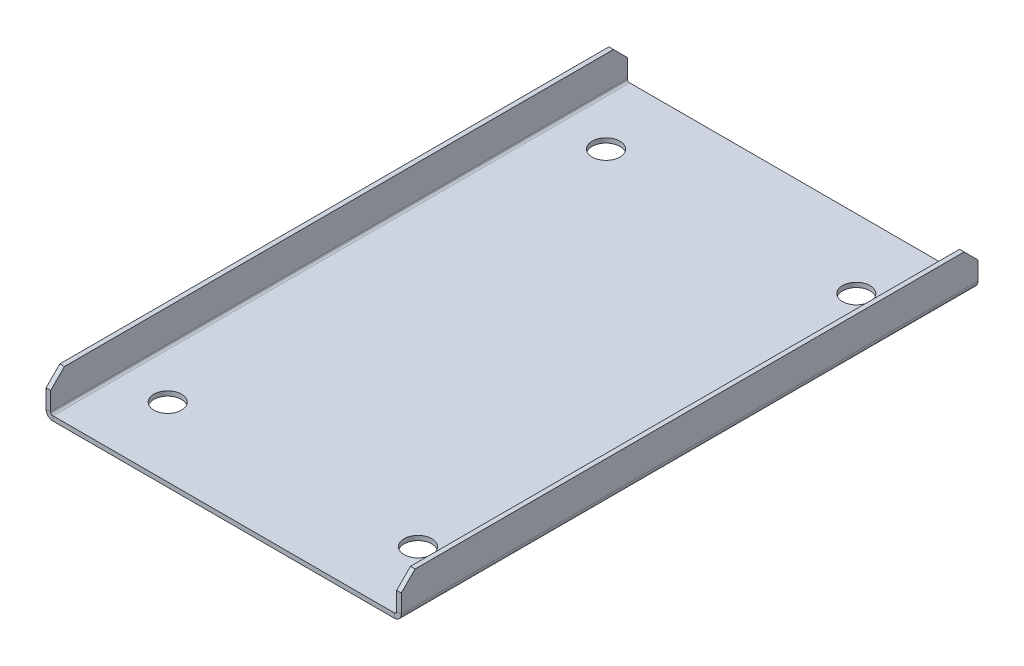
ISO-10303-21;
HEADER;
FILE_DESCRIPTION(('STEP AP214'),'2;1');
FILE_NAME('part.step','',(''),(''),'','','');
FILE_SCHEMA(('AUTOMOTIVE_DESIGN { 1 0 10303 214 1 1 1 1 }'));
ENDSEC;
DATA;
#1=APPLICATION_CONTEXT('core data for automotive mechanical design processes');
#2=APPLICATION_PROTOCOL_DEFINITION('international standard','automotive_design',2000,#1);
#3=PRODUCT_CONTEXT('',#1,'mechanical');
#4=PRODUCT('Part','Part','',(#3));
#5=PRODUCT_RELATED_PRODUCT_CATEGORY('part','',(#4));
#6=PRODUCT_DEFINITION_FORMATION('','',#4);
#7=PRODUCT_DEFINITION_CONTEXT('part definition',#1,'design');
#8=PRODUCT_DEFINITION('design','',#6,#7);
#9=PRODUCT_DEFINITION_SHAPE('','',#8);
#10=(LENGTH_UNIT() NAMED_UNIT(*) SI_UNIT(.MILLI.,.METRE.));
#11=(NAMED_UNIT(*) PLANE_ANGLE_UNIT() SI_UNIT($,.RADIAN.));
#12=(NAMED_UNIT(*) SI_UNIT($,.STERADIAN.) SOLID_ANGLE_UNIT());
#13=UNCERTAINTY_MEASURE_WITH_UNIT(LENGTH_MEASURE(1.E-05),#10,'distance_accuracy_value','');
#14=(GEOMETRIC_REPRESENTATION_CONTEXT(3) GLOBAL_UNCERTAINTY_ASSIGNED_CONTEXT((#13)) GLOBAL_UNIT_ASSIGNED_CONTEXT((#10,
#11,#12)) REPRESENTATION_CONTEXT('',''));
#15=CARTESIAN_POINT('',(0.,0.,0.));
#16=DIRECTION('',(0.,0.,1.));
#17=DIRECTION('',(1.,0.,0.));
#18=AXIS2_PLACEMENT_3D('',#15,#16,#17);
#19=CARTESIAN_POINT('',(-350.783386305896,15.,-250.));
#20=DIRECTION('',(0.,1.,0.));
#21=DIRECTION('',(-1.,0.,0.));
#22=AXIS2_PLACEMENT_3D('',#19,#20,#21);
#23=PLANE('',#22);
#24=DIRECTION('',(1.,0.,0.));
#25=VECTOR('',#24,1.);
#26=CARTESIAN_POINT('',(-350.783386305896,15.,-6.00000000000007));
#27=LINE('',#26,#25);
#28=CARTESIAN_POINT('',(150.,15.,-6.00000000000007));
#29=VERTEX_POINT('',#28);
#30=CARTESIAN_POINT('',(152.,15.,-6.00000000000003));
#31=VERTEX_POINT('',#30);
#32=EDGE_CURVE('E283',#29,#31,#27,.T.);
#33=ORIENTED_EDGE('',*,*,#32,.T.);
#34=DIRECTION('',(0.,0.,1.));
#35=VECTOR('',#34,1.);
#36=CARTESIAN_POINT('',(152.,15.,-250.));
#37=LINE('',#36,#35);
#38=CARTESIAN_POINT('',(152.,15.,-244.));
#39=VERTEX_POINT('',#38);
#40=EDGE_CURVE('E267',#39,#31,#37,.T.);
#41=ORIENTED_EDGE('',*,*,#40,.F.);
#42=DIRECTION('',(1.,0.,0.));
#43=VECTOR('',#42,1.);
#44=CARTESIAN_POINT('',(-350.783386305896,15.,-244.));
#45=LINE('',#44,#43);
#46=CARTESIAN_POINT('',(150.,15.,-244.));
#47=VERTEX_POINT('',#46);
#48=EDGE_CURVE('E278',#47,#39,#45,.T.);
#49=ORIENTED_EDGE('',*,*,#48,.F.);
#50=DIRECTION('',(0.,0.,1.));
#51=VECTOR('',#50,1.);
#52=CARTESIAN_POINT('',(150.,15.,-250.));
#53=LINE('',#52,#51);
#54=EDGE_CURVE('E281',#47,#29,#53,.T.);
#55=ORIENTED_EDGE('',*,*,#54,.T.);
#56=EDGE_LOOP('',(#33,#41,#49,#55));
#57=FACE_BOUND('',#56,.T.);
#58=ADVANCED_FACE('F29',(#57),#23,.T.);
#59=CARTESIAN_POINT('',(-350.783386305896,9.00000000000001,-250.));
#60=DIRECTION('',(0.,-0.707106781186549,0.707106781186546));
#61=DIRECTION('',(0.,0.707106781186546,0.707106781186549));
#62=AXIS2_PLACEMENT_3D('',#59,#60,#61);
#63=PLANE('',#62);
#64=DIRECTION('',(0.,0.707106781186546,0.707106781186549));
#65=VECTOR('',#64,1.);
#66=CARTESIAN_POINT('',(152.,4.50000000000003,-254.5));
#67=LINE('',#66,#65);
#68=CARTESIAN_POINT('',(152.,9.00000000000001,-250.));
#69=VERTEX_POINT('',#68);
#70=EDGE_CURVE('E269',#69,#39,#67,.T.);
#71=ORIENTED_EDGE('',*,*,#70,.F.);
#72=DIRECTION('',(1.,0.,0.));
#73=VECTOR('',#72,1.);
#74=CARTESIAN_POINT('',(-350.783386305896,9.00000000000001,-250.));
#75=LINE('',#74,#73);
#76=CARTESIAN_POINT('',(150.,9.00000000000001,-250.));
#77=VERTEX_POINT('',#76);
#78=EDGE_CURVE('E263',#77,#69,#75,.T.);
#79=ORIENTED_EDGE('',*,*,#78,.F.);
#80=DIRECTION('',(0.,-0.707106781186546,-0.707106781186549));
#81=VECTOR('',#80,1.);
#82=CARTESIAN_POINT('',(150.,9.00000000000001,-250.));
#83=LINE('',#82,#81);
#84=EDGE_CURVE('E11',#47,#77,#83,.T.);
#85=ORIENTED_EDGE('',*,*,#84,.F.);
#86=ORIENTED_EDGE('',*,*,#48,.T.);
#87=EDGE_LOOP('',(#71,#79,#85,#86));
#88=FACE_BOUND('',#87,.T.);
#89=ADVANCED_FACE('F359',(#88),#63,.F.);
#90=CARTESIAN_POINT('',(-350.783386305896,15.,-6.00000000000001));
#91=DIRECTION('',(0.,-0.707106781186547,-0.707106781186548));
#92=DIRECTION('',(0.,-0.707106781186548,0.707106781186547));
#93=AXIS2_PLACEMENT_3D('',#90,#91,#92);
#94=PLANE('',#93);
#95=DIRECTION('',(0.,0.707106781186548,-0.707106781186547));
#96=VECTOR('',#95,1.);
#97=CARTESIAN_POINT('',(152.,129.5,-120.5));
#98=LINE('',#97,#96);
#99=CARTESIAN_POINT('',(152.,8.99999999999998,0.));
#100=VERTEX_POINT('',#99);
#101=EDGE_CURVE('E265',#31,#100,#98,.F.);
#102=ORIENTED_EDGE('',*,*,#101,.F.);
#103=ORIENTED_EDGE('',*,*,#32,.F.);
#104=DIRECTION('',(0.,-0.707106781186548,0.707106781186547));
#105=VECTOR('',#104,1.);
#106=CARTESIAN_POINT('',(150.,15.,-6.00000000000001));
#107=LINE('',#106,#105);
#108=CARTESIAN_POINT('',(150.,8.99999999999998,0.));
#109=VERTEX_POINT('',#108);
#110=EDGE_CURVE('E39',#109,#29,#107,.F.);
#111=ORIENTED_EDGE('',*,*,#110,.F.);
#112=DIRECTION('',(1.,0.,0.));
#113=VECTOR('',#112,1.);
#114=CARTESIAN_POINT('',(-350.783386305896,8.99999999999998,0.));
#115=LINE('',#114,#113);
#116=EDGE_CURVE('E275',#109,#100,#115,.T.);
#117=ORIENTED_EDGE('',*,*,#116,.T.);
#118=EDGE_LOOP('',(#102,#103,#111,#117));
#119=FACE_BOUND('',#118,.T.);
#120=ADVANCED_FACE('F365',(#119),#94,.F.);
#121=CARTESIAN_POINT('',(-350.783386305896,0.,0.));
#122=DIRECTION('',(0.,0.,-1.));
#123=DIRECTION('',(0.,-1.,0.));
#124=AXIS2_PLACEMENT_3D('',#121,#122,#123);
#125=PLANE('',#124);
#126=DIRECTION('',(0.,1.,0.));
#127=VECTOR('',#126,1.);
#128=CARTESIAN_POINT('',(152.,0.,0.));
#129=LINE('',#128,#127);
#130=CARTESIAN_POINT('',(152.,0.999999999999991,1.11022302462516E-13));
#131=VERTEX_POINT('',#130);
#132=EDGE_CURVE('E272',#131,#100,#129,.T.);
#133=ORIENTED_EDGE('',*,*,#132,.T.);
#134=ORIENTED_EDGE('',*,*,#116,.F.);
#135=DIRECTION('',(0.,1.,0.));
#136=VECTOR('',#135,1.);
#137=CARTESIAN_POINT('',(150.,0.,0.));
#138=LINE('',#137,#136);
#139=CARTESIAN_POINT('',(150.,1.,0.));
#140=VERTEX_POINT('',#139);
#141=EDGE_CURVE('E85',#140,#109,#138,.T.);
#142=ORIENTED_EDGE('',*,*,#141,.F.);
#143=DIRECTION('',(1.,0.,0.));
#144=VECTOR('',#143,1.);
#145=CARTESIAN_POINT('',(-350.783386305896,1.,0.));
#146=LINE('',#145,#144);
#147=EDGE_CURVE('E175',#140,#131,#146,.T.);
#148=ORIENTED_EDGE('',*,*,#147,.T.);
#149=EDGE_LOOP('',(#133,#134,#142,#148));
#150=FACE_BOUND('',#149,.T.);
#151=ADVANCED_FACE('F373',(#150),#125,.F.);
#152=CARTESIAN_POINT('',(152.,0.,-250.));
#153=DIRECTION('',(1.,0.,0.));
#154=DIRECTION('',(0.,0.,-1.));
#155=AXIS2_PLACEMENT_3D('',#152,#153,#154);
#156=PLANE('',#155);
#157=DIRECTION('',(0.,0.,1.));
#158=VECTOR('',#157,1.);
#159=CARTESIAN_POINT('',(152.,1.,0.));
#160=LINE('',#159,#158);
#161=CARTESIAN_POINT('',(152.,1.,-250.));
#162=VERTEX_POINT('',#161);
#163=EDGE_CURVE('E285',#162,#131,#160,.T.);
#164=ORIENTED_EDGE('',*,*,#163,.F.);
#165=DIRECTION('',(0.,-1.,0.));
#166=VECTOR('',#165,1.);
#167=CARTESIAN_POINT('',(152.,0.,-250.));
#168=LINE('',#167,#166);
#169=EDGE_CURVE('E261',#69,#162,#168,.T.);
#170=ORIENTED_EDGE('',*,*,#169,.F.);
#171=ORIENTED_EDGE('',*,*,#70,.T.);
#172=ORIENTED_EDGE('',*,*,#40,.T.);
#173=ORIENTED_EDGE('',*,*,#101,.T.);
#174=ORIENTED_EDGE('',*,*,#132,.F.);
#175=EDGE_LOOP('',(#164,#170,#171,#172,#173,#174));
#176=FACE_BOUND('',#175,.T.);
#177=ADVANCED_FACE('F377',(#176),#156,.T.);
#178=CARTESIAN_POINT('',(-350.783386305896,0.,-250.));
#179=DIRECTION('',(0.,0.,-1.));
#180=DIRECTION('',(0.,-1.,0.));
#181=AXIS2_PLACEMENT_3D('',#178,#179,#180);
#182=PLANE('',#181);
#183=ORIENTED_EDGE('',*,*,#78,.T.);
#184=ORIENTED_EDGE('',*,*,#169,.T.);
#185=DIRECTION('',(1.,0.,0.));
#186=VECTOR('',#185,1.);
#187=CARTESIAN_POINT('',(-350.783386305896,1.,-250.));
#188=LINE('',#187,#186);
#189=CARTESIAN_POINT('',(150.,1.,-250.));
#190=VERTEX_POINT('',#189);
#191=EDGE_CURVE('E33',#190,#162,#188,.T.);
#192=ORIENTED_EDGE('',*,*,#191,.F.);
#193=DIRECTION('',(0.,-1.,0.));
#194=VECTOR('',#193,1.);
#195=CARTESIAN_POINT('',(150.,0.,-250.));
#196=LINE('',#195,#194);
#197=EDGE_CURVE('E48',#77,#190,#196,.T.);
#198=ORIENTED_EDGE('',*,*,#197,.F.);
#199=EDGE_LOOP('',(#183,#184,#192,#198));
#200=FACE_BOUND('',#199,.T.);
#201=ADVANCED_FACE('F379',(#200),#182,.T.);
#202=CARTESIAN_POINT('',(150.,0.,-250.));
#203=DIRECTION('',(1.,0.,0.));
#204=DIRECTION('',(0.,0.,-1.));
#205=AXIS2_PLACEMENT_3D('',#202,#203,#204);
#206=PLANE('',#205);
#207=ORIENTED_EDGE('',*,*,#197,.T.);
#208=DIRECTION('',(0.,0.,1.));
#209=VECTOR('',#208,1.);
#210=CARTESIAN_POINT('',(150.,1.,0.));
#211=LINE('',#210,#209);
#212=EDGE_CURVE('E258',#190,#140,#211,.T.);
#213=ORIENTED_EDGE('',*,*,#212,.T.);
#214=ORIENTED_EDGE('',*,*,#141,.T.);
#215=ORIENTED_EDGE('',*,*,#110,.T.);
#216=ORIENTED_EDGE('',*,*,#54,.F.);
#217=ORIENTED_EDGE('',*,*,#84,.T.);
#218=EDGE_LOOP('',(#207,#213,#214,#215,#216,#217));
#219=FACE_BOUND('',#218,.T.);
#220=ADVANCED_FACE('F31',(#219),#206,.F.);
#221=CARTESIAN_POINT('',(500.783386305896,15.,-250.));
#222=DIRECTION('',(0.,-1.,0.));
#223=DIRECTION('',(1.,0.,0.));
#224=AXIS2_PLACEMENT_3D('',#221,#222,#223);
#225=PLANE('',#224);
#226=DIRECTION('',(0.,0.,1.));
#227=VECTOR('',#226,1.);
#228=CARTESIAN_POINT('',(-2.,15.,-250.));
#229=LINE('',#228,#227);
#230=CARTESIAN_POINT('',(-2.,15.,-244.));
#231=VERTEX_POINT('',#230);
#232=CARTESIAN_POINT('',(-2.,15.,-6.00000000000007));
#233=VERTEX_POINT('',#232);
#234=EDGE_CURVE('E248',#231,#233,#229,.T.);
#235=ORIENTED_EDGE('',*,*,#234,.T.);
#236=DIRECTION('',(-1.,0.,0.));
#237=VECTOR('',#236,1.);
#238=CARTESIAN_POINT('',(500.783386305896,15.,-6.00000000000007));
#239=LINE('',#238,#237);
#240=CARTESIAN_POINT('',(0.,15.,-6.00000000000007));
#241=VERTEX_POINT('',#240);
#242=EDGE_CURVE('E242',#241,#233,#239,.T.);
#243=ORIENTED_EDGE('',*,*,#242,.F.);
#244=DIRECTION('',(0.,0.,1.));
#245=VECTOR('',#244,1.);
#246=CARTESIAN_POINT('',(0.,15.,-250.));
#247=LINE('',#246,#245);
#248=CARTESIAN_POINT('',(0.,15.,-244.));
#249=VERTEX_POINT('',#248);
#250=EDGE_CURVE('E216',#249,#241,#247,.T.);
#251=ORIENTED_EDGE('',*,*,#250,.F.);
#252=DIRECTION('',(-1.,0.,0.));
#253=VECTOR('',#252,1.);
#254=CARTESIAN_POINT('',(500.783386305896,15.,-244.));
#255=LINE('',#254,#253);
#256=EDGE_CURVE('E245',#249,#231,#255,.T.);
#257=ORIENTED_EDGE('',*,*,#256,.T.);
#258=EDGE_LOOP('',(#235,#243,#251,#257));
#259=FACE_BOUND('',#258,.T.);
#260=ADVANCED_FACE('F385',(#259),#225,.F.);
#261=CARTESIAN_POINT('',(500.783386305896,15.,-6.00000000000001));
#262=DIRECTION('',(0.,-0.707106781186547,-0.707106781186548));
#263=DIRECTION('',(0.,0.707106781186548,-0.707106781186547));
#264=AXIS2_PLACEMENT_3D('',#261,#262,#263);
#265=PLANE('',#264);
#266=DIRECTION('',(0.,-0.707106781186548,0.707106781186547));
#267=VECTOR('',#266,1.);
#268=CARTESIAN_POINT('',(-2.,137.,-128.));
#269=LINE('',#268,#267);
#270=CARTESIAN_POINT('',(-2.,8.99999999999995,0.));
#271=VERTEX_POINT('',#270);
#272=EDGE_CURVE('E231',#271,#233,#269,.F.);
#273=ORIENTED_EDGE('',*,*,#272,.F.);
#274=DIRECTION('',(-1.,0.,0.));
#275=VECTOR('',#274,1.);
#276=CARTESIAN_POINT('',(500.783386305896,8.99999999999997,0.));
#277=LINE('',#276,#275);
#278=CARTESIAN_POINT('',(0.,8.99999999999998,0.));
#279=VERTEX_POINT('',#278);
#280=EDGE_CURVE('E222',#279,#271,#277,.T.);
#281=ORIENTED_EDGE('',*,*,#280,.F.);
#282=DIRECTION('',(0.,0.707106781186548,-0.707106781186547));
#283=VECTOR('',#282,1.);
#284=CARTESIAN_POINT('',(0.,15.,-6.00000000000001));
#285=LINE('',#284,#283);
#286=EDGE_CURVE('E94',#241,#279,#285,.F.);
#287=ORIENTED_EDGE('',*,*,#286,.F.);
#288=ORIENTED_EDGE('',*,*,#242,.T.);
#289=EDGE_LOOP('',(#273,#281,#287,#288));
#290=FACE_BOUND('',#289,.T.);
#291=ADVANCED_FACE('F397',(#290),#265,.F.);
#292=CARTESIAN_POINT('',(500.783386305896,8.99999999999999,-250.));
#293=DIRECTION('',(0.,-0.707106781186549,0.707106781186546));
#294=DIRECTION('',(0.,-0.707106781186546,-0.707106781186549));
#295=AXIS2_PLACEMENT_3D('',#292,#293,#294);
#296=PLANE('',#295);
#297=DIRECTION('',(0.,-0.707106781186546,-0.707106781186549));
#298=VECTOR('',#297,1.);
#299=CARTESIAN_POINT('',(-2.,12.,-247.));
#300=LINE('',#299,#298);
#301=CARTESIAN_POINT('',(-2.,8.99999999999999,-250.));
#302=VERTEX_POINT('',#301);
#303=EDGE_CURVE('E228',#231,#302,#300,.T.);
#304=ORIENTED_EDGE('',*,*,#303,.F.);
#305=ORIENTED_EDGE('',*,*,#256,.F.);
#306=DIRECTION('',(0.,0.707106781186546,0.707106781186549));
#307=VECTOR('',#306,1.);
#308=CARTESIAN_POINT('',(0.,8.99999999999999,-250.));
#309=LINE('',#308,#307);
#310=CARTESIAN_POINT('',(0.,8.99999999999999,-250.));
#311=VERTEX_POINT('',#310);
#312=EDGE_CURVE('E218',#311,#249,#309,.T.);
#313=ORIENTED_EDGE('',*,*,#312,.F.);
#314=DIRECTION('',(-1.,0.,0.));
#315=VECTOR('',#314,1.);
#316=CARTESIAN_POINT('',(500.783386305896,8.99999999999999,-250.));
#317=LINE('',#316,#315);
#318=EDGE_CURVE('E239',#311,#302,#317,.T.);
#319=ORIENTED_EDGE('',*,*,#318,.T.);
#320=EDGE_LOOP('',(#304,#305,#313,#319));
#321=FACE_BOUND('',#320,.T.);
#322=ADVANCED_FACE('F403',(#321),#296,.F.);
#323=CARTESIAN_POINT('',(500.783386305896,15.,-250.));
#324=DIRECTION('',(0.,0.,-1.));
#325=DIRECTION('',(0.,1.,0.));
#326=AXIS2_PLACEMENT_3D('',#323,#324,#325);
#327=PLANE('',#326);
#328=DIRECTION('',(-1.,0.,0.));
#329=VECTOR('',#328,1.);
#330=CARTESIAN_POINT('',(500.783386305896,0.999999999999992,-250.));
#331=LINE('',#330,#329);
#332=CARTESIAN_POINT('',(0.,0.999999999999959,-250.));
#333=VERTEX_POINT('',#332);
#334=CARTESIAN_POINT('',(-2.,0.999999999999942,-250.));
#335=VERTEX_POINT('',#334);
#336=EDGE_CURVE('E236',#333,#335,#331,.T.);
#337=ORIENTED_EDGE('',*,*,#336,.T.);
#338=DIRECTION('',(0.,-1.,0.));
#339=VECTOR('',#338,1.);
#340=CARTESIAN_POINT('',(-2.,15.,-250.));
#341=LINE('',#340,#339);
#342=EDGE_CURVE('E226',#302,#335,#341,.T.);
#343=ORIENTED_EDGE('',*,*,#342,.F.);
#344=ORIENTED_EDGE('',*,*,#318,.F.);
#345=DIRECTION('',(0.,-1.,0.));
#346=VECTOR('',#345,1.);
#347=CARTESIAN_POINT('',(0.,15.,-250.));
#348=LINE('',#347,#346);
#349=EDGE_CURVE('E234',#311,#333,#348,.T.);
#350=ORIENTED_EDGE('',*,*,#349,.T.);
#351=EDGE_LOOP('',(#337,#343,#344,#350));
#352=FACE_BOUND('',#351,.T.);
#353=ADVANCED_FACE('F409',(#352),#327,.T.);
#354=CARTESIAN_POINT('',(-2.,15.,-250.));
#355=DIRECTION('',(-1.,0.,0.));
#356=DIRECTION('',(0.,-1.,0.));
#357=AXIS2_PLACEMENT_3D('',#354,#355,#356);
#358=PLANE('',#357);
#359=DIRECTION('',(0.,0.,-1.));
#360=VECTOR('',#359,1.);
#361=CARTESIAN_POINT('',(-2.,1.,-250.));
#362=LINE('',#361,#360);
#363=CARTESIAN_POINT('',(-2.,0.999999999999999,0.));
#364=VERTEX_POINT('',#363);
#365=EDGE_CURVE('E250',#364,#335,#362,.T.);
#366=ORIENTED_EDGE('',*,*,#365,.F.);
#367=DIRECTION('',(0.,-1.,0.));
#368=VECTOR('',#367,1.);
#369=CARTESIAN_POINT('',(-2.,15.,0.));
#370=LINE('',#369,#368);
#371=EDGE_CURVE('E224',#271,#364,#370,.T.);
#372=ORIENTED_EDGE('',*,*,#371,.F.);
#373=ORIENTED_EDGE('',*,*,#272,.T.);
#374=ORIENTED_EDGE('',*,*,#234,.F.);
#375=ORIENTED_EDGE('',*,*,#303,.T.);
#376=ORIENTED_EDGE('',*,*,#342,.T.);
#377=EDGE_LOOP('',(#366,#372,#373,#374,#375,#376));
#378=FACE_BOUND('',#377,.T.);
#379=ADVANCED_FACE('F413',(#378),#358,.T.);
#380=CARTESIAN_POINT('',(500.783386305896,15.,0.));
#381=DIRECTION('',(0.,0.,-1.));
#382=DIRECTION('',(0.,1.,0.));
#383=AXIS2_PLACEMENT_3D('',#380,#381,#382);
#384=PLANE('',#383);
#385=ORIENTED_EDGE('',*,*,#371,.T.);
#386=DIRECTION('',(-1.,0.,0.));
#387=VECTOR('',#386,1.);
#388=CARTESIAN_POINT('',(500.783386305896,0.999999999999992,0.));
#389=LINE('',#388,#387);
#390=CARTESIAN_POINT('',(0.,0.999999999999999,0.));
#391=VERTEX_POINT('',#390);
#392=EDGE_CURVE('E214',#391,#364,#389,.T.);
#393=ORIENTED_EDGE('',*,*,#392,.F.);
#394=DIRECTION('',(0.,-1.,0.));
#395=VECTOR('',#394,1.);
#396=CARTESIAN_POINT('',(0.,15.,0.));
#397=LINE('',#396,#395);
#398=EDGE_CURVE('E123',#279,#391,#397,.T.);
#399=ORIENTED_EDGE('',*,*,#398,.F.);
#400=ORIENTED_EDGE('',*,*,#280,.T.);
#401=EDGE_LOOP('',(#385,#393,#399,#400));
#402=FACE_BOUND('',#401,.T.);
#403=ADVANCED_FACE('F416',(#402),#384,.F.);
#404=CARTESIAN_POINT('',(0.,15.,-250.));
#405=DIRECTION('',(-1.,0.,0.));
#406=DIRECTION('',(0.,-1.,0.));
#407=AXIS2_PLACEMENT_3D('',#404,#405,#406);
#408=PLANE('',#407);
#409=ORIENTED_EDGE('',*,*,#398,.T.);
#410=DIRECTION('',(0.,0.,-1.));
#411=VECTOR('',#410,1.);
#412=CARTESIAN_POINT('',(0.,1.,-250.));
#413=LINE('',#412,#411);
#414=EDGE_CURVE('E126',#391,#333,#413,.T.);
#415=ORIENTED_EDGE('',*,*,#414,.T.);
#416=ORIENTED_EDGE('',*,*,#349,.F.);
#417=ORIENTED_EDGE('',*,*,#312,.T.);
#418=ORIENTED_EDGE('',*,*,#250,.T.);
#419=ORIENTED_EDGE('',*,*,#286,.T.);
#420=EDGE_LOOP('',(#409,#415,#416,#417,#418,#419));
#421=FACE_BOUND('',#420,.T.);
#422=ADVANCED_FACE('F356',(#421),#408,.F.);
#423=CARTESIAN_POINT('',(0.,581.047330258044,0.));
#424=DIRECTION('',(0.,0.,-1.));
#425=DIRECTION('',(-1.,0.,0.));
#426=AXIS2_PLACEMENT_3D('',#423,#424,#425);
#427=PLANE('',#426);
#428=DIRECTION('',(1.,0.,0.));
#429=VECTOR('',#428,1.);
#430=CARTESIAN_POINT('',(0.,-2.,0.));
#431=LINE('',#430,#429);
#432=CARTESIAN_POINT('',(1.,-2.,0.));
#433=VERTEX_POINT('',#432);
#434=CARTESIAN_POINT('',(149.,-2.00000000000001,1.11022302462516E-13));
#435=VERTEX_POINT('',#434);
#436=EDGE_CURVE('E204',#433,#435,#431,.T.);
#437=ORIENTED_EDGE('',*,*,#436,.T.);
#438=DIRECTION('',(0.,-1.,0.));
#439=VECTOR('',#438,1.);
#440=CARTESIAN_POINT('',(149.,581.047330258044,0.));
#441=LINE('',#440,#439);
#442=CARTESIAN_POINT('',(149.,0.,1.11022302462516E-13));
#443=VERTEX_POINT('',#442);
#444=EDGE_CURVE('E174',#443,#435,#441,.T.);
#445=ORIENTED_EDGE('',*,*,#444,.F.);
#446=DIRECTION('',(1.,0.,0.));
#447=VECTOR('',#446,1.);
#448=CARTESIAN_POINT('',(0.,0.,0.));
#449=LINE('',#448,#447);
#450=CARTESIAN_POINT('',(1.,0.,0.));
#451=VERTEX_POINT('',#450);
#452=EDGE_CURVE('E194',#451,#443,#449,.T.);
#453=ORIENTED_EDGE('',*,*,#452,.F.);
#454=DIRECTION('',(0.,-1.,0.));
#455=VECTOR('',#454,1.);
#456=CARTESIAN_POINT('',(1.,581.047330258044,0.));
#457=LINE('',#456,#455);
#458=EDGE_CURVE('E189',#451,#433,#457,.T.);
#459=ORIENTED_EDGE('',*,*,#458,.T.);
#460=EDGE_LOOP('',(#437,#445,#453,#459));
#461=FACE_BOUND('',#460,.T.);
#462=ADVANCED_FACE('F202',(#461),#427,.F.);
#463=CARTESIAN_POINT('',(0.,581.047330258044,-250.));
#464=DIRECTION('',(0.,0.,-1.));
#465=DIRECTION('',(-1.,0.,0.));
#466=AXIS2_PLACEMENT_3D('',#463,#464,#465);
#467=PLANE('',#466);
#468=DIRECTION('',(0.,-1.,0.));
#469=VECTOR('',#468,1.);
#470=CARTESIAN_POINT('',(149.,581.047330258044,-250.));
#471=LINE('',#470,#469);
#472=CARTESIAN_POINT('',(149.,0.,-250.));
#473=VERTEX_POINT('',#472);
#474=CARTESIAN_POINT('',(149.,-2.,-250.));
#475=VERTEX_POINT('',#474);
#476=EDGE_CURVE('E205',#473,#475,#471,.T.);
#477=ORIENTED_EDGE('',*,*,#476,.T.);
#478=DIRECTION('',(1.,0.,0.));
#479=VECTOR('',#478,1.);
#480=CARTESIAN_POINT('',(0.,-2.,-250.));
#481=LINE('',#480,#479);
#482=CARTESIAN_POINT('',(0.999999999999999,-2.,-250.));
#483=VERTEX_POINT('',#482);
#484=EDGE_CURVE('E330',#483,#475,#481,.T.);
#485=ORIENTED_EDGE('',*,*,#484,.F.);
#486=DIRECTION('',(0.,-1.,0.));
#487=VECTOR('',#486,1.);
#488=CARTESIAN_POINT('',(1.,581.047330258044,-250.));
#489=LINE('',#488,#487);
#490=CARTESIAN_POINT('',(1.,0.,-250.));
#491=VERTEX_POINT('',#490);
#492=EDGE_CURVE('E209',#491,#483,#489,.T.);
#493=ORIENTED_EDGE('',*,*,#492,.F.);
#494=DIRECTION('',(1.,0.,0.));
#495=VECTOR('',#494,1.);
#496=CARTESIAN_POINT('',(0.,0.,-250.));
#497=LINE('',#496,#495);
#498=EDGE_CURVE('E190',#491,#473,#497,.T.);
#499=ORIENTED_EDGE('',*,*,#498,.T.);
#500=EDGE_LOOP('',(#477,#485,#493,#499));
#501=FACE_BOUND('',#500,.T.);
#502=ADVANCED_FACE('F347',(#501),#467,.T.);
#503=CARTESIAN_POINT('',(0.,0.,-250.));
#504=DIRECTION('',(0.,-1.,0.));
#505=DIRECTION('',(0.,0.,-1.));
#506=AXIS2_PLACEMENT_3D('',#503,#504,#505);
#507=PLANE('',#506);
#508=CARTESIAN_POINT('',(20.75,0.,-30.));
#509=DIRECTION('',(0.,1.,0.));
#510=DIRECTION('',(0.,0.,1.));
#511=AXIS2_PLACEMENT_3D('',#508,#509,#510);
#512=CIRCLE('',#511,6.);
#513=CARTESIAN_POINT('',(20.75,0.,-24.));
#514=VERTEX_POINT('',#513);
#515=EDGE_CURVE('E305',#514,#514,#512,.T.);
#516=ORIENTED_EDGE('',*,*,#515,.F.);
#517=EDGE_LOOP('',(#516));
#518=FACE_BOUND('',#517,.T.);
#519=CARTESIAN_POINT('',(20.75,0.,-220.));
#520=DIRECTION('',(0.,1.,0.));
#521=DIRECTION('',(0.,0.,1.));
#522=AXIS2_PLACEMENT_3D('',#519,#520,#521);
#523=CIRCLE('',#522,6.);
#524=CARTESIAN_POINT('',(20.75,0.,-214.));
#525=VERTEX_POINT('',#524);
#526=EDGE_CURVE('E311',#525,#525,#523,.T.);
#527=ORIENTED_EDGE('',*,*,#526,.F.);
#528=EDGE_LOOP('',(#527));
#529=FACE_BOUND('',#528,.T.);
#530=CARTESIAN_POINT('',(129.25,0.,-30.));
#531=DIRECTION('',(0.,1.,0.));
#532=DIRECTION('',(0.,0.,1.));
#533=AXIS2_PLACEMENT_3D('',#530,#531,#532);
#534=CIRCLE('',#533,6.);
#535=CARTESIAN_POINT('',(129.25,0.,-24.));
#536=VERTEX_POINT('',#535);
#537=EDGE_CURVE('E317',#536,#536,#534,.T.);
#538=ORIENTED_EDGE('',*,*,#537,.F.);
#539=EDGE_LOOP('',(#538));
#540=FACE_BOUND('',#539,.T.);
#541=CARTESIAN_POINT('',(129.25,0.,-220.));
#542=DIRECTION('',(0.,1.,0.));
#543=DIRECTION('',(0.,0.,1.));
#544=AXIS2_PLACEMENT_3D('',#541,#542,#543);
#545=CIRCLE('',#544,6.);
#546=CARTESIAN_POINT('',(129.25,0.,-214.));
#547=VERTEX_POINT('',#546);
#548=EDGE_CURVE('E323',#547,#547,#545,.T.);
#549=ORIENTED_EDGE('',*,*,#548,.F.);
#550=EDGE_LOOP('',(#549));
#551=FACE_BOUND('',#550,.T.);
#552=DIRECTION('',(0.,0.,1.));
#553=VECTOR('',#552,1.);
#554=CARTESIAN_POINT('',(149.,0.,0.));
#555=LINE('',#554,#553);
#556=EDGE_CURVE('E182',#473,#443,#555,.T.);
#557=ORIENTED_EDGE('',*,*,#556,.F.);
#558=ORIENTED_EDGE('',*,*,#498,.F.);
#559=DIRECTION('',(0.,0.,-1.));
#560=VECTOR('',#559,1.);
#561=CARTESIAN_POINT('',(1.,0.,-250.));
#562=LINE('',#561,#560);
#563=EDGE_CURVE('E197',#451,#491,#562,.T.);
#564=ORIENTED_EDGE('',*,*,#563,.F.);
#565=ORIENTED_EDGE('',*,*,#452,.T.);
#566=EDGE_LOOP('',(#557,#558,#564,#565));
#567=FACE_BOUND('',#566,.T.);
#568=ADVANCED_FACE('F195',(#518,#529,#540,#551,#567),#507,.F.);
#569=CARTESIAN_POINT('',(0.,-2.,-250.));
#570=DIRECTION('',(0.,-1.,0.));
#571=DIRECTION('',(0.,0.,-1.));
#572=AXIS2_PLACEMENT_3D('',#569,#570,#571);
#573=PLANE('',#572);
#574=CARTESIAN_POINT('',(20.75,-2.,-30.));
#575=DIRECTION('',(0.,1.,0.));
#576=DIRECTION('',(0.,0.,1.));
#577=AXIS2_PLACEMENT_3D('',#574,#575,#576);
#578=CIRCLE('',#577,6.);
#579=CARTESIAN_POINT('',(20.75,-2.,-24.));
#580=VERTEX_POINT('',#579);
#581=EDGE_CURVE('E308',#580,#580,#578,.T.);
#582=ORIENTED_EDGE('',*,*,#581,.T.);
#583=EDGE_LOOP('',(#582));
#584=FACE_BOUND('',#583,.T.);
#585=CARTESIAN_POINT('',(20.75,-2.,-220.));
#586=DIRECTION('',(0.,1.,0.));
#587=DIRECTION('',(0.,0.,1.));
#588=AXIS2_PLACEMENT_3D('',#585,#586,#587);
#589=CIRCLE('',#588,6.);
#590=CARTESIAN_POINT('',(20.75,-2.,-214.));
#591=VERTEX_POINT('',#590);
#592=EDGE_CURVE('E314',#591,#591,#589,.T.);
#593=ORIENTED_EDGE('',*,*,#592,.T.);
#594=EDGE_LOOP('',(#593));
#595=FACE_BOUND('',#594,.T.);
#596=CARTESIAN_POINT('',(129.25,-2.,-30.));
#597=DIRECTION('',(0.,1.,0.));
#598=DIRECTION('',(0.,0.,1.));
#599=AXIS2_PLACEMENT_3D('',#596,#597,#598);
#600=CIRCLE('',#599,6.);
#601=CARTESIAN_POINT('',(129.25,-2.,-24.));
#602=VERTEX_POINT('',#601);
#603=EDGE_CURVE('E320',#602,#602,#600,.T.);
#604=ORIENTED_EDGE('',*,*,#603,.T.);
#605=EDGE_LOOP('',(#604));
#606=FACE_BOUND('',#605,.T.);
#607=CARTESIAN_POINT('',(129.25,-2.,-220.));
#608=DIRECTION('',(0.,1.,0.));
#609=DIRECTION('',(0.,0.,1.));
#610=AXIS2_PLACEMENT_3D('',#607,#608,#609);
#611=CIRCLE('',#610,6.);
#612=CARTESIAN_POINT('',(129.25,-2.,-214.));
#613=VERTEX_POINT('',#612);
#614=EDGE_CURVE('E326',#613,#613,#611,.T.);
#615=ORIENTED_EDGE('',*,*,#614,.T.);
#616=EDGE_LOOP('',(#615));
#617=FACE_BOUND('',#616,.T.);
#618=ORIENTED_EDGE('',*,*,#484,.T.);
#619=DIRECTION('',(0.,0.,1.));
#620=VECTOR('',#619,1.);
#621=CARTESIAN_POINT('',(149.,-2.,0.));
#622=LINE('',#621,#620);
#623=EDGE_CURVE('E134',#475,#435,#622,.T.);
#624=ORIENTED_EDGE('',*,*,#623,.T.);
#625=ORIENTED_EDGE('',*,*,#436,.F.);
#626=DIRECTION('',(0.,0.,-1.));
#627=VECTOR('',#626,1.);
#628=CARTESIAN_POINT('',(1.,-2.,-250.));
#629=LINE('',#628,#627);
#630=EDGE_CURVE('E142',#433,#483,#629,.T.);
#631=ORIENTED_EDGE('',*,*,#630,.T.);
#632=EDGE_LOOP('',(#618,#624,#625,#631));
#633=FACE_BOUND('',#632,.T.);
#634=ADVANCED_FACE('F346',(#584,#595,#606,#617,#633),#573,.T.);
#635=CARTESIAN_POINT('',(129.25,-2.,-220.));
#636=DIRECTION('',(0.,1.,0.));
#637=DIRECTION('',(0.,0.,1.));
#638=AXIS2_PLACEMENT_3D('',#635,#636,#637);
#639=CYLINDRICAL_SURFACE('',#638,6.);
#640=ORIENTED_EDGE('',*,*,#614,.F.);
#641=EDGE_LOOP('',(#640));
#642=FACE_BOUND('',#641,.T.);
#643=ORIENTED_EDGE('',*,*,#548,.T.);
#644=EDGE_LOOP('',(#643));
#645=FACE_BOUND('',#644,.T.);
#646=ADVANCED_FACE('F458',(#642,#645),#639,.F.);
#647=CARTESIAN_POINT('',(129.25,-2.,-30.));
#648=DIRECTION('',(0.,1.,0.));
#649=DIRECTION('',(0.,0.,1.));
#650=AXIS2_PLACEMENT_3D('',#647,#648,#649);
#651=CYLINDRICAL_SURFACE('',#650,6.);
#652=ORIENTED_EDGE('',*,*,#603,.F.);
#653=EDGE_LOOP('',(#652));
#654=FACE_BOUND('',#653,.T.);
#655=ORIENTED_EDGE('',*,*,#537,.T.);
#656=EDGE_LOOP('',(#655));
#657=FACE_BOUND('',#656,.T.);
#658=ADVANCED_FACE('F454',(#654,#657),#651,.F.);
#659=CARTESIAN_POINT('',(20.75,-2.,-220.));
#660=DIRECTION('',(0.,1.,0.));
#661=DIRECTION('',(0.,0.,1.));
#662=AXIS2_PLACEMENT_3D('',#659,#660,#661);
#663=CYLINDRICAL_SURFACE('',#662,6.);
#664=ORIENTED_EDGE('',*,*,#592,.F.);
#665=EDGE_LOOP('',(#664));
#666=FACE_BOUND('',#665,.T.);
#667=ORIENTED_EDGE('',*,*,#526,.T.);
#668=EDGE_LOOP('',(#667));
#669=FACE_BOUND('',#668,.T.);
#670=ADVANCED_FACE('F450',(#666,#669),#663,.F.);
#671=CARTESIAN_POINT('',(20.75,-2.,-30.));
#672=DIRECTION('',(0.,1.,0.));
#673=DIRECTION('',(0.,0.,1.));
#674=AXIS2_PLACEMENT_3D('',#671,#672,#673);
#675=CYLINDRICAL_SURFACE('',#674,6.);
#676=ORIENTED_EDGE('',*,*,#581,.F.);
#677=EDGE_LOOP('',(#676));
#678=FACE_BOUND('',#677,.T.);
#679=ORIENTED_EDGE('',*,*,#515,.T.);
#680=EDGE_LOOP('',(#679));
#681=FACE_BOUND('',#680,.T.);
#682=ADVANCED_FACE('F445',(#678,#681),#675,.F.);
#683=CARTESIAN_POINT('',(1.,1.,-250.));
#684=DIRECTION('',(0.,0.,-1.));
#685=DIRECTION('',(-1.,0.,0.));
#686=AXIS2_PLACEMENT_3D('',#683,#684,#685);
#687=PLANE('',#686);
#688=ORIENTED_EDGE('',*,*,#336,.F.);
#689=CARTESIAN_POINT('',(1.,1.,-250.));
#690=DIRECTION('',(0.,0.,1.));
#691=DIRECTION('',(1.,0.,0.));
#692=AXIS2_PLACEMENT_3D('',#689,#690,#691);
#693=CIRCLE('',#692,1.);
#694=EDGE_CURVE('E291',#333,#491,#693,.T.);
#695=ORIENTED_EDGE('',*,*,#694,.T.);
#696=ORIENTED_EDGE('',*,*,#492,.T.);
#697=CARTESIAN_POINT('',(1.,1.,-250.));
#698=DIRECTION('',(0.,0.,1.));
#699=DIRECTION('',(1.,0.,0.));
#700=AXIS2_PLACEMENT_3D('',#697,#698,#699);
#701=CIRCLE('',#700,3.);
#702=EDGE_CURVE('E301',#335,#483,#701,.T.);
#703=ORIENTED_EDGE('',*,*,#702,.F.);
#704=EDGE_LOOP('',(#688,#695,#696,#703));
#705=FACE_BOUND('',#704,.T.);
#706=ADVANCED_FACE('F339',(#705),#687,.T.);
#707=CARTESIAN_POINT('',(1.,1.,0.));
#708=DIRECTION('',(0.,0.,1.));
#709=DIRECTION('',(1.,0.,0.));
#710=AXIS2_PLACEMENT_3D('',#707,#708,#709);
#711=PLANE('',#710);
#712=CARTESIAN_POINT('',(1.,1.,0.));
#713=DIRECTION('',(0.,0.,1.));
#714=DIRECTION('',(1.,0.,0.));
#715=AXIS2_PLACEMENT_3D('',#712,#713,#714);
#716=CIRCLE('',#715,1.);
#717=EDGE_CURVE('E294',#451,#391,#716,.F.);
#718=ORIENTED_EDGE('',*,*,#717,.T.);
#719=ORIENTED_EDGE('',*,*,#392,.T.);
#720=CARTESIAN_POINT('',(1.,1.,0.));
#721=DIRECTION('',(0.,0.,1.));
#722=DIRECTION('',(1.,0.,0.));
#723=AXIS2_PLACEMENT_3D('',#720,#721,#722);
#724=CIRCLE('',#723,3.);
#725=EDGE_CURVE('E303',#433,#364,#724,.F.);
#726=ORIENTED_EDGE('',*,*,#725,.F.);
#727=ORIENTED_EDGE('',*,*,#458,.F.);
#728=EDGE_LOOP('',(#718,#719,#726,#727));
#729=FACE_BOUND('',#728,.T.);
#730=ADVANCED_FACE('F427',(#729),#711,.T.);
#731=CARTESIAN_POINT('',(1.,1.,-559.40452428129));
#732=DIRECTION('',(0.,0.,1.));
#733=DIRECTION('',(1.,0.,0.));
#734=AXIS2_PLACEMENT_3D('',#731,#732,#733);
#735=CYLINDRICAL_SURFACE('',#734,3.);
#736=ORIENTED_EDGE('',*,*,#630,.F.);
#737=ORIENTED_EDGE('',*,*,#725,.T.);
#738=ORIENTED_EDGE('',*,*,#365,.T.);
#739=ORIENTED_EDGE('',*,*,#702,.T.);
#740=EDGE_LOOP('',(#736,#737,#738,#739));
#741=FACE_BOUND('',#740,.T.);
#742=ADVANCED_FACE('F343',(#741),#735,.T.);
#743=CARTESIAN_POINT('',(1.,1.,-559.40452428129));
#744=DIRECTION('',(0.,0.,1.));
#745=DIRECTION('',(1.,0.,0.));
#746=AXIS2_PLACEMENT_3D('',#743,#744,#745);
#747=CYLINDRICAL_SURFACE('',#746,1.);
#748=ORIENTED_EDGE('',*,*,#563,.T.);
#749=ORIENTED_EDGE('',*,*,#694,.F.);
#750=ORIENTED_EDGE('',*,*,#414,.F.);
#751=ORIENTED_EDGE('',*,*,#717,.F.);
#752=EDGE_LOOP('',(#748,#749,#750,#751));
#753=FACE_BOUND('',#752,.T.);
#754=ADVANCED_FACE('F430',(#753),#747,.F.);
#755=CARTESIAN_POINT('',(149.,1.,0.));
#756=DIRECTION('',(0.,0.,1.));
#757=DIRECTION('',(1.,0.,0.));
#758=AXIS2_PLACEMENT_3D('',#755,#756,#757);
#759=PLANE('',#758);
#760=ORIENTED_EDGE('',*,*,#147,.F.);
#761=CARTESIAN_POINT('',(149.,1.,1.11022302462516E-13));
#762=DIRECTION('',(0.,0.,-1.));
#763=DIRECTION('',(-1.,0.,0.));
#764=AXIS2_PLACEMENT_3D('',#761,#762,#763);
#765=CIRCLE('',#764,1.00000000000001);
#766=EDGE_CURVE('E169',#140,#443,#765,.T.);
#767=ORIENTED_EDGE('',*,*,#766,.T.);
#768=ORIENTED_EDGE('',*,*,#444,.T.);
#769=CARTESIAN_POINT('',(149.,1.,1.11022302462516E-13));
#770=DIRECTION('',(0.,0.,-1.));
#771=DIRECTION('',(-1.,0.,0.));
#772=AXIS2_PLACEMENT_3D('',#769,#770,#771);
#773=CIRCLE('',#772,3.00000000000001);
#774=EDGE_CURVE('E292',#131,#435,#773,.T.);
#775=ORIENTED_EDGE('',*,*,#774,.F.);
#776=EDGE_LOOP('',(#760,#767,#768,#775));
#777=FACE_BOUND('',#776,.T.);
#778=ADVANCED_FACE('F171',(#777),#759,.T.);
#779=CARTESIAN_POINT('',(149.,1.,-250.));
#780=DIRECTION('',(0.,0.,-1.));
#781=DIRECTION('',(-1.,0.,0.));
#782=AXIS2_PLACEMENT_3D('',#779,#780,#781);
#783=PLANE('',#782);
#784=CARTESIAN_POINT('',(149.,1.,-250.));
#785=DIRECTION('',(0.,0.,-1.));
#786=DIRECTION('',(-1.,0.,0.));
#787=AXIS2_PLACEMENT_3D('',#784,#785,#786);
#788=CIRCLE('',#787,1.00000000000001);
#789=EDGE_CURVE('E178',#473,#190,#788,.F.);
#790=ORIENTED_EDGE('',*,*,#789,.T.);
#791=ORIENTED_EDGE('',*,*,#191,.T.);
#792=CARTESIAN_POINT('',(149.,1.,-250.));
#793=DIRECTION('',(0.,0.,-1.));
#794=DIRECTION('',(-1.,0.,0.));
#795=AXIS2_PLACEMENT_3D('',#792,#793,#794);
#796=CIRCLE('',#795,3.00000000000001);
#797=EDGE_CURVE('E289',#475,#162,#796,.F.);
#798=ORIENTED_EDGE('',*,*,#797,.F.);
#799=ORIENTED_EDGE('',*,*,#476,.F.);
#800=EDGE_LOOP('',(#790,#791,#798,#799));
#801=FACE_BOUND('',#800,.T.);
#802=ADVANCED_FACE('F288',(#801),#783,.T.);
#803=CARTESIAN_POINT('',(149.,1.,301.762481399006));
#804=DIRECTION('',(0.,0.,-1.));
#805=DIRECTION('',(-1.,0.,0.));
#806=AXIS2_PLACEMENT_3D('',#803,#804,#805);
#807=CYLINDRICAL_SURFACE('',#806,3.00000000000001);
#808=ORIENTED_EDGE('',*,*,#623,.F.);
#809=ORIENTED_EDGE('',*,*,#797,.T.);
#810=ORIENTED_EDGE('',*,*,#163,.T.);
#811=ORIENTED_EDGE('',*,*,#774,.T.);
#812=EDGE_LOOP('',(#808,#809,#810,#811));
#813=FACE_BOUND('',#812,.T.);
#814=ADVANCED_FACE('F290',(#813),#807,.T.);
#815=CARTESIAN_POINT('',(149.,1.,301.762481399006));
#816=DIRECTION('',(0.,0.,-1.));
#817=DIRECTION('',(-1.,0.,0.));
#818=AXIS2_PLACEMENT_3D('',#815,#816,#817);
#819=CYLINDRICAL_SURFACE('',#818,1.00000000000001);
#820=ORIENTED_EDGE('',*,*,#556,.T.);
#821=ORIENTED_EDGE('',*,*,#766,.F.);
#822=ORIENTED_EDGE('',*,*,#212,.F.);
#823=ORIENTED_EDGE('',*,*,#789,.F.);
#824=EDGE_LOOP('',(#820,#821,#822,#823));
#825=FACE_BOUND('',#824,.T.);
#826=ADVANCED_FACE('F184',(#825),#819,.F.);
#827=CLOSED_SHELL('',(#58,#89,#120,#151,#177,#201,#220,#260,#291,#322,#353,#379,#403,#422,#462,
#502,#568,#634,#646,#658,#670,#682,#706,#730,#742,#754,#778,#802,#814,#826));
#828=MANIFOLD_SOLID_BREP('B2',#827);
#829=ADVANCED_BREP_SHAPE_REPRESENTATION('',(#18,#828),#14);
#830=SHAPE_DEFINITION_REPRESENTATION(#9,#829);
ENDSEC;
END-ISO-10303-21;
